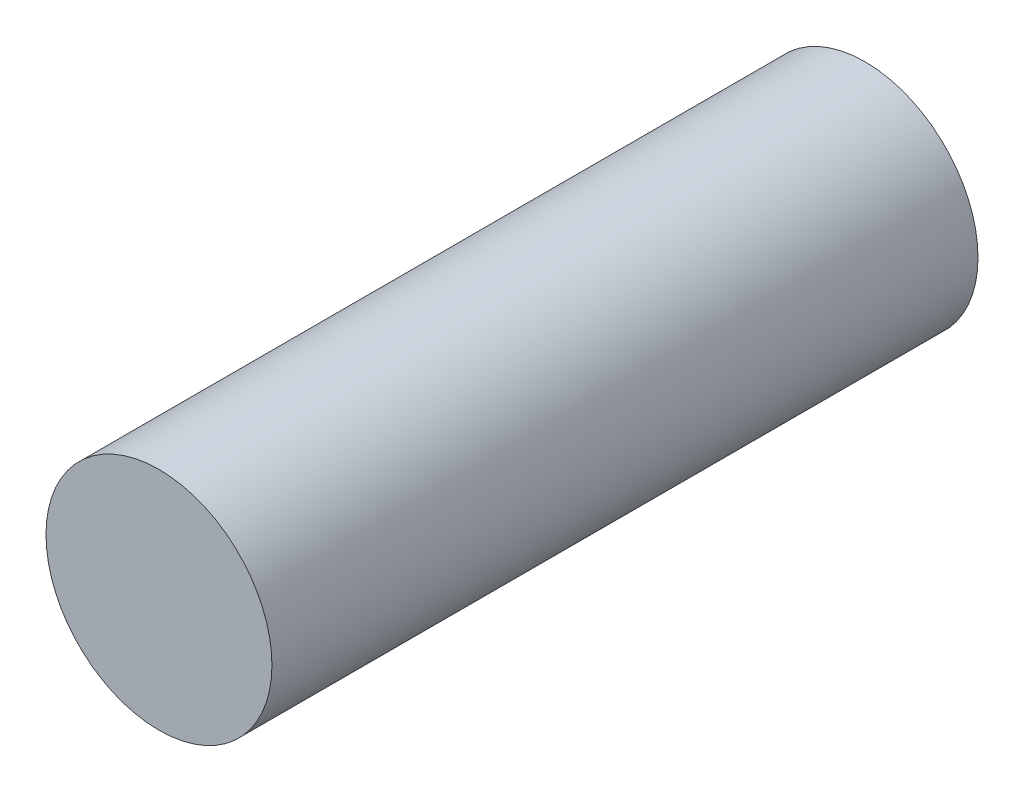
from build123d import *

# Parameters (mm, degrees)
ESQUISSE1_R      = 4
EXTRUSION1_DEPTH = 25


with BuildPart() as part:
    # Esquisse1 → Extrusion1 (new body)
    with BuildSketch(Plane.XY):
        Circle(ESQUISSE1_R)
    extrude(amount=EXTRUSION1_DEPTH)


solid = part.part
